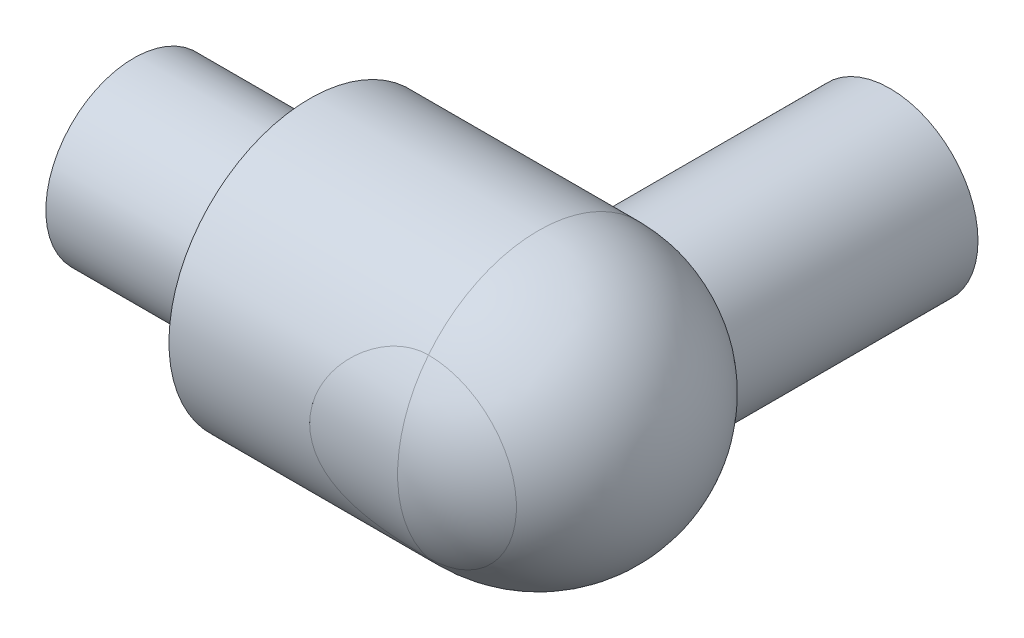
ISO-10303-21;
HEADER;
FILE_DESCRIPTION(('STEP AP214'),'2;1');
FILE_NAME('part.step','',(''),(''),'','','');
FILE_SCHEMA(('AUTOMOTIVE_DESIGN { 1 0 10303 214 1 1 1 1 }'));
ENDSEC;
DATA;
#1=APPLICATION_CONTEXT('core data for automotive mechanical design processes');
#2=APPLICATION_PROTOCOL_DEFINITION('international standard','automotive_design',2000,#1);
#3=PRODUCT_CONTEXT('',#1,'mechanical');
#4=PRODUCT('Part','Part','',(#3));
#5=PRODUCT_RELATED_PRODUCT_CATEGORY('part','',(#4));
#6=PRODUCT_DEFINITION_FORMATION('','',#4);
#7=PRODUCT_DEFINITION_CONTEXT('part definition',#1,'design');
#8=PRODUCT_DEFINITION('design','',#6,#7);
#9=PRODUCT_DEFINITION_SHAPE('','',#8);
#10=(LENGTH_UNIT() NAMED_UNIT(*) SI_UNIT(.MILLI.,.METRE.));
#11=(NAMED_UNIT(*) PLANE_ANGLE_UNIT() SI_UNIT($,.RADIAN.));
#12=(NAMED_UNIT(*) SI_UNIT($,.STERADIAN.) SOLID_ANGLE_UNIT());
#13=UNCERTAINTY_MEASURE_WITH_UNIT(LENGTH_MEASURE(1.E-05),#10,'distance_accuracy_value','');
#14=(GEOMETRIC_REPRESENTATION_CONTEXT(3) GLOBAL_UNCERTAINTY_ASSIGNED_CONTEXT((#13)) GLOBAL_UNIT_ASSIGNED_CONTEXT((#10,
#11,#12)) REPRESENTATION_CONTEXT('',''));
#15=CARTESIAN_POINT('',(0.,0.,0.));
#16=DIRECTION('',(0.,0.,1.));
#17=DIRECTION('',(1.,0.,0.));
#18=AXIS2_PLACEMENT_3D('',#15,#16,#17);
#19=CARTESIAN_POINT('',(23.,0.,8.001));
#20=DIRECTION('',(0.,0.,-1.));
#21=DIRECTION('',(-1.,0.,0.));
#22=AXIS2_PLACEMENT_3D('',#19,#20,#21);
#23=CYLINDRICAL_SURFACE('',#22,5.);
#24=CARTESIAN_POINT('',(23.,0.,-20.));
#25=DIRECTION('',(0.,0.,1.));
#26=DIRECTION('',(1.,0.,0.));
#27=AXIS2_PLACEMENT_3D('',#24,#25,#26);
#28=CIRCLE('',#27,5.);
#29=CARTESIAN_POINT('',(28.,0.,-20.));
#30=VERTEX_POINT('',#29);
#31=EDGE_CURVE('E12',#30,#30,#28,.T.);
#32=ORIENTED_EDGE('',*,*,#31,.T.);
#33=EDGE_LOOP('',(#32));
#34=FACE_BOUND('',#33,.T.);
#35=CARTESIAN_POINT('',(23.,0.,6.2449979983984));
#36=DIRECTION('',(0.,0.,-1.));
#37=DIRECTION('',(-1.,0.,0.));
#38=AXIS2_PLACEMENT_3D('',#35,#36,#37);
#39=CIRCLE('',#38,5.);
#40=CARTESIAN_POINT('',(23.,-5.,6.2449979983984));
#41=VERTEX_POINT('',#40);
#42=CARTESIAN_POINT('',(23.,5.,6.2449979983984));
#43=VERTEX_POINT('',#42);
#44=EDGE_CURVE('E52',#41,#43,#39,.F.);
#45=ORIENTED_EDGE('',*,*,#44,.F.);
#46=CARTESIAN_POINT('',(18.,0.,8.));
#47=CARTESIAN_POINT('',(18.000000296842,-0.127079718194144,7.99999969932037));
#48=CARTESIAN_POINT('',(18.0048512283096,-0.254165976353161,7.99696526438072));
#49=CARTESIAN_POINT('',(18.0241874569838,-0.507365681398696,7.98490163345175));
#50=CARTESIAN_POINT('',(18.0386769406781,-0.633478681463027,7.97586983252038));
#51=CARTESIAN_POINT('',(18.0771121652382,-0.883879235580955,7.95201844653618));
#52=CARTESIAN_POINT('',(18.101071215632,-1.00816396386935,7.93719071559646));
#53=CARTESIAN_POINT('',(18.1581302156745,-1.25388007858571,7.90210083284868));
#54=CARTESIAN_POINT('',(18.1912340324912,-1.3753102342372,7.88183638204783));
#55=CARTESIAN_POINT('',(18.2659676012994,-1.61383677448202,7.83646507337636));
#56=CARTESIAN_POINT('',(18.3075500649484,-1.73095311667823,7.81138511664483));
#57=CARTESIAN_POINT('',(18.3988984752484,-1.96091650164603,7.75685494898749));
#58=CARTESIAN_POINT('',(18.448667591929,-2.07376186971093,7.7274030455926));
#59=CARTESIAN_POINT('',(18.6094966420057,-2.40491190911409,7.63340708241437));
#60=CARTESIAN_POINT('',(18.7321634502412,-2.61609848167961,7.5631697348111));
#61=CARTESIAN_POINT('',(19.0155539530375,-3.03193014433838,7.40680295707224));
#62=CARTESIAN_POINT('',(19.178534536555,-3.23470598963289,7.31985233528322));
#63=CARTESIAN_POINT('',(19.5328993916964,-3.61195776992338,7.1412401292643));
#64=CARTESIAN_POINT('',(19.7243218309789,-3.78639500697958,7.04957232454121));
#65=CARTESIAN_POINT('',(20.0442857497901,-4.03551059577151,6.90836217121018));
#66=CARTESIAN_POINT('',(20.1642871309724,-4.12074022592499,6.85772204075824));
#67=CARTESIAN_POINT('',(20.4121510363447,-4.28074637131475,6.758996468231));
#68=CARTESIAN_POINT('',(20.5400150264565,-4.35552092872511,6.71091150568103));
#69=CARTESIAN_POINT('',(20.802884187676,-4.49385262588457,6.61907677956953));
#70=CARTESIAN_POINT('',(20.9378778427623,-4.55742717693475,6.57532033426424));
#71=CARTESIAN_POINT('',(21.2146224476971,-4.67278116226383,6.49385156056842));
#72=CARTESIAN_POINT('',(21.3563734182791,-4.72456056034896,6.45613925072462));
#73=CARTESIAN_POINT('',(21.6081335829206,-4.80367778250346,6.39737739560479));
#74=CARTESIAN_POINT('',(21.7168360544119,-4.83387146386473,6.37454329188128));
#75=CARTESIAN_POINT('',(21.9369191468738,-4.8869893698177,6.33391313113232));
#76=CARTESIAN_POINT('',(22.0482991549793,-4.90991524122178,6.31611593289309));
#77=CARTESIAN_POINT('',(22.2729763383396,-4.94817199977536,6.2861900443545));
#78=CARTESIAN_POINT('',(22.3862710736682,-4.96351189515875,6.27405463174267));
#79=CARTESIAN_POINT('',(22.6141412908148,-4.98640391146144,6.25587655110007));
#80=CARTESIAN_POINT('',(22.7287168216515,-4.99395573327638,6.249834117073));
#81=CARTESIAN_POINT('',(22.9585586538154,-5.00115324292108,6.24407626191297));
#82=CARTESIAN_POINT('',(23.0738259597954,-5.00077951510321,6.24437637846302));
#83=CARTESIAN_POINT('',(23.3039059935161,-4.99208386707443,6.2513301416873));
#84=CARTESIAN_POINT('',(23.4187185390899,-4.98375903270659,6.25798611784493));
#85=CARTESIAN_POINT('',(23.6470210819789,-4.95928874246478,6.27739584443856));
#86=CARTESIAN_POINT('',(23.7605106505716,-4.94314081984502,6.29015151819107));
#87=CARTESIAN_POINT('',(23.9853862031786,-4.90327193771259,6.32127805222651));
#88=CARTESIAN_POINT('',(24.0967712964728,-4.87954784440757,6.33965123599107));
#89=CARTESIAN_POINT('',(24.4216199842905,-4.79874186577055,6.40129934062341));
#90=CARTESIAN_POINT('',(24.6312924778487,-4.73140686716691,6.4516270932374));
#91=CARTESIAN_POINT('',(25.0366820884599,-4.57160139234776,6.565824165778));
#92=CARTESIAN_POINT('',(25.2323942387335,-4.47912202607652,6.62969827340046));
#93=CARTESIAN_POINT('',(25.6433146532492,-4.25180409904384,6.77818972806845));
#94=CARTESIAN_POINT('',(25.855335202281,-4.1122797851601,6.86445305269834));
#95=CARTESIAN_POINT('',(26.2553491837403,-3.80349790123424,7.04023909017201));
#96=CARTESIAN_POINT('',(26.443317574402,-3.63420977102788,7.12976507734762));
#97=CARTESIAN_POINT('',(26.7195685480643,-3.34462792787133,7.26825220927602));
#98=CARTESIAN_POINT('',(26.816742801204,-3.23332743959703,7.31856628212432));
#99=CARTESIAN_POINT('',(27.0013511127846,-3.00184758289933,7.4165140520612));
#100=CARTESIAN_POINT('',(27.0887887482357,-2.88167150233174,7.464148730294));
#101=CARTESIAN_POINT('',(27.2532332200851,-2.63291547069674,7.55548277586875));
#102=CARTESIAN_POINT('',(27.3302372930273,-2.50433330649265,7.59918109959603));
#103=CARTESIAN_POINT('',(27.4729252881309,-2.23953943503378,7.68138405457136));
#104=CARTESIAN_POINT('',(27.5386161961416,-2.1033325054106,7.71989188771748));
#105=CARTESIAN_POINT('',(27.6546688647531,-1.83158498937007,7.78870197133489));
#106=CARTESIAN_POINT('',(27.7056622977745,-1.69639792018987,7.81933279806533));
#107=CARTESIAN_POINT('',(27.796020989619,-1.42097512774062,7.87404113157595));
#108=CARTESIAN_POINT('',(27.8353928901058,-1.28074233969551,7.89812238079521));
#109=CARTESIAN_POINT('',(27.9018673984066,-0.996484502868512,7.9389934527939));
#110=CARTESIAN_POINT('',(27.9289810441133,-0.852462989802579,7.95578983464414));
#111=CARTESIAN_POINT('',(27.970490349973,-0.561915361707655,7.98157299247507));
#112=CARTESIAN_POINT('',(27.9848881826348,-0.415389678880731,7.99056110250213));
#113=CARTESIAN_POINT('',(27.999520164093,-0.143238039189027,7.99969867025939));
#114=CARTESIAN_POINT('',(28.001540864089,-0.017741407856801,8.00096292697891));
#115=CARTESIAN_POINT('',(27.9961427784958,0.232966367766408,7.99758945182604));
#116=CARTESIAN_POINT('',(27.9887246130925,0.358177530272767,7.9929521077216));
#117=CARTESIAN_POINT('',(27.9645562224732,0.60732783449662,7.97789005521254));
#118=CARTESIAN_POINT('',(27.9478068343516,0.731267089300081,7.96746586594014));
#119=CARTESIAN_POINT('',(27.9052093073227,0.97696969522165,7.9410830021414));
#120=CARTESIAN_POINT('',(27.87936100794,1.09873300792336,7.92512423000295));
#121=CARTESIAN_POINT('',(27.8200905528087,1.33450834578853,7.88877344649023));
#122=CARTESIAN_POINT('',(27.7870073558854,1.44863666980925,7.8685811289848));
#123=CARTESIAN_POINT('',(27.7131109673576,1.67350231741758,7.82384532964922));
#124=CARTESIAN_POINT('',(27.6722951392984,1.78423846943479,7.7993003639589));
#125=CARTESIAN_POINT('',(27.5388502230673,2.11043845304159,7.7198451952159));
#126=CARTESIAN_POINT('',(27.4351772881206,2.32007565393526,7.65908557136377));
#127=CARTESIAN_POINT('',(27.1899279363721,2.74037159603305,7.51959499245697));
#128=CARTESIAN_POINT('',(27.0455818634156,2.94899750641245,7.43966908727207));
#129=CARTESIAN_POINT('',(26.7288284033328,3.340560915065,7.27228030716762));
#130=CARTESIAN_POINT('',(26.5563898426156,3.52346945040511,7.18480911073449));
#131=CARTESIAN_POINT('',(26.1594550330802,3.88590040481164,6.99623419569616));
#132=CARTESIAN_POINT('',(25.9310356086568,4.06107692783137,6.89499476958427));
#133=CARTESIAN_POINT('',(25.4445124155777,4.37121122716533,6.70267107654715));
#134=CARTESIAN_POINT('',(25.186429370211,4.50619684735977,6.61157980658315));
#135=CARTESIAN_POINT('',(24.7011860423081,4.70739703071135,6.46933988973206));
#136=CARTESIAN_POINT('',(24.478884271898,4.78209607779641,6.41382106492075));
#137=CARTESIAN_POINT('',(24.1364345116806,4.87056932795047,6.34656596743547));
#138=CARTESIAN_POINT('',(24.0208098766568,4.89612834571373,6.32682054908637));
#139=CARTESIAN_POINT('',(23.787213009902,4.93906627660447,6.29335959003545));
#140=CARTESIAN_POINT('',(23.6692418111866,4.95644870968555,6.27964145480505));
#141=CARTESIAN_POINT('',(23.4310629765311,4.98283345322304,6.25872646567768));
#142=CARTESIAN_POINT('',(23.3108461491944,4.99178464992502,6.25156939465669));
#143=CARTESIAN_POINT('',(23.0698650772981,5.00096567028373,6.24422754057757));
#144=CARTESIAN_POINT('',(22.9491008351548,5.00119553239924,6.24404272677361));
#145=CARTESIAN_POINT('',(22.7080244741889,4.99292458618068,6.25065867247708));
#146=CARTESIAN_POINT('',(22.5877125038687,4.98442112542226,6.2574615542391));
#147=CARTESIAN_POINT('',(22.3486063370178,4.95884706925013,6.27774556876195));
#148=CARTESIAN_POINT('',(22.2298121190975,4.94177659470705,6.2912266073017));
#149=CARTESIAN_POINT('',(21.8960286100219,4.88153513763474,6.33822773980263));
#150=CARTESIAN_POINT('',(21.6837622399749,4.82847742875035,6.37907576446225));
#151=CARTESIAN_POINT('',(21.271420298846,4.69670428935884,6.47669777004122));
#152=CARTESIAN_POINT('',(21.0713498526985,4.61797815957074,6.53347839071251));
#153=CARTESIAN_POINT('',(20.657624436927,4.42410573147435,6.66655793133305));
#154=CARTESIAN_POINT('',(20.4461960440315,4.30533683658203,6.74449249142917));
#155=CARTESIAN_POINT('',(20.0442492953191,4.04000963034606,6.90670498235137));
#156=CARTESIAN_POINT('',(19.8537480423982,3.89342885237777,6.99098800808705));
#157=CARTESIAN_POINT('',(19.4599160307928,3.54264024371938,7.17608994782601));
#158=CARTESIAN_POINT('',(19.2615221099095,3.33276887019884,7.27687640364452));
#159=CARTESIAN_POINT('',(18.9918997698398,2.99268031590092,7.42018359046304));
#160=CARTESIAN_POINT('',(18.9066216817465,2.87498419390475,7.46667962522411));
#161=CARTESIAN_POINT('',(18.7460851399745,2.63162062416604,7.55588019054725));
#162=CARTESIAN_POINT('',(18.6708214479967,2.50595739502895,7.59858669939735));
#163=CARTESIAN_POINT('',(18.5308937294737,2.24695585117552,7.67916888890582));
#164=CARTESIAN_POINT('',(18.4662558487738,2.11359966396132,7.71703260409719));
#165=CARTESIAN_POINT('',(18.3486499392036,1.84039127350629,7.78670745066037));
#166=CARTESIAN_POINT('',(18.2956751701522,1.70054287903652,7.81852207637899));
#167=CARTESIAN_POINT('',(18.2022871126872,1.41574969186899,7.87506644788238));
#168=CARTESIAN_POINT('',(18.1618400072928,1.2708198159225,7.89981525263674));
#169=CARTESIAN_POINT('',(18.0940489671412,0.976912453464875,7.94151359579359));
#170=CARTESIAN_POINT('',(18.0666953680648,0.827938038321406,7.95846888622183));
#171=CARTESIAN_POINT('',(18.0308184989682,0.565708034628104,7.98076605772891));
#172=CARTESIAN_POINT('',(18.0192744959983,0.453012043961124,7.98796542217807));
#173=CARTESIAN_POINT('',(18.0038648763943,0.22687913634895,7.99758267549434));
#174=CARTESIAN_POINT('',(17.9999997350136,0.113442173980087,8.00000026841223));
#175=CARTESIAN_POINT('',(18.,0.,8.));
#176=B_SPLINE_CURVE_WITH_KNOTS('',3,(#46,#47,#48,#49,#50,#51,#52,#53,#54,#55,#56,#57,#58,#59,
#60,#61,#62,#63,#64,#65,#66,#67,#68,#69,#70,#71,#72,#73,#74,#75,#76,#77,#78,#79,#80,#81,#82,#83,
#84,#85,#86,#87,#88,#89,#90,#91,#92,#93,#94,#95,#96,#97,#98,#99,#100,#101,#102,#103,#104,#105,
#106,#107,#108,#109,#110,#111,#112,#113,#114,#115,#116,#117,#118,#119,#120,#121,#122,#123,#124,
#125,#126,#127,#128,#129,#130,#131,#132,#133,#134,#135,#136,#137,#138,#139,#140,#141,#142,#143,
#144,#145,#146,#147,#148,#149,#150,#151,#152,#153,#154,#155,#156,#157,#158,#159,#160,#161,#162,
#163,#164,#165,#166,#167,#168,#169,#170,#171,#172,#173,#174,#175),.UNSPECIFIED.,.T.,.F.,(4,2,2,
2,2,2,2,2,2,2,2,2,2,2,2,2,2,2,2,2,2,2,2,2,2,2,2,2,2,2,2,2,2,2,2,2,2,2,2,2,2,2,2,2,2,2,2,2,2,2,2,
2,2,2,2,2,2,2,2,2,2,2,2,2,4),(0.,0.381122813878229,0.762411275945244,1.14423755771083,
1.52622555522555,1.90613865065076,2.2861992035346,3.04547146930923,3.86537873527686,
4.68639638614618,5.15288943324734,5.61946971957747,6.08531814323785,6.55116799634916,
6.89615022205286,7.24105422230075,7.58554766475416,7.93005433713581,8.27540506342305,
8.62088241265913,8.96646876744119,9.31219825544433,9.98712845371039,10.6622975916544,
11.463592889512,12.2657157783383,12.7334704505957,13.2010527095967,13.6687585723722,
14.1361745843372,14.5786070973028,15.0207862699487,15.4625664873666,15.9042712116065,
16.280349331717,16.6564027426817,17.0324224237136,17.4084487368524,17.7696430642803,
18.1309607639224,18.8530325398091,19.6479898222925,20.4438353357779,21.355208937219,
22.2659496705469,22.9857781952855,23.3455439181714,23.705154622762,24.0669316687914,
24.4287071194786,24.7905924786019,25.1524727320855,25.8172983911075,26.482401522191,
27.2437925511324,28.0058012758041,28.9187931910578,29.3761295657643,29.8332257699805,
30.2914303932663,30.7493695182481,31.2060614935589,31.6624158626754,32.0026174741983,
32.3428401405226),.UNSPECIFIED.);
#177=EDGE_CURVE('E61',#43,#41,#176,.T.);
#178=ORIENTED_EDGE('',*,*,#177,.F.);
#179=EDGE_LOOP('',(#45,#178));
#180=FACE_BOUND('',#179,.T.);
#181=ADVANCED_FACE('F45',(#34,#180),#23,.T.);
#182=CARTESIAN_POINT('',(23.,0.,-20.));
#183=DIRECTION('',(0.,0.,1.));
#184=DIRECTION('',(1.,0.,0.));
#185=AXIS2_PLACEMENT_3D('',#182,#183,#184);
#186=PLANE('',#185);
#187=ORIENTED_EDGE('',*,*,#31,.F.);
#188=EDGE_LOOP('',(#187));
#189=FACE_BOUND('',#188,.T.);
#190=ADVANCED_FACE('F78',(#189),#186,.F.);
#191=CARTESIAN_POINT('',(23.,0.,0.));
#192=DIRECTION('',(-1.,0.,0.));
#193=DIRECTION('',(0.,1.,0.));
#194=AXIS2_PLACEMENT_3D('',#191,#192,#193);
#195=SPHERICAL_SURFACE('',#194,8.);
#196=ORIENTED_EDGE('',*,*,#44,.T.);
#197=CARTESIAN_POINT('',(23.,0.,0.));
#198=DIRECTION('',(-1.,0.,0.));
#199=DIRECTION('',(0.,0.,1.));
#200=AXIS2_PLACEMENT_3D('',#197,#198,#199);
#201=CIRCLE('',#200,8.);
#202=EDGE_CURVE('E58',#41,#43,#201,.T.);
#203=ORIENTED_EDGE('',*,*,#202,.F.);
#204=EDGE_LOOP('',(#196,#203));
#205=FACE_BOUND('',#204,.T.);
#206=ADVANCED_FACE('F67',(#205),#195,.T.);
#207=CARTESIAN_POINT('',(0.,0.,0.));
#208=DIRECTION('',(-1.,0.,0.));
#209=DIRECTION('',(0.,0.,1.));
#210=AXIS2_PLACEMENT_3D('',#207,#208,#209);
#211=CYLINDRICAL_SURFACE('',#210,8.);
#212=ORIENTED_EDGE('',*,*,#177,.T.);
#213=ORIENTED_EDGE('',*,*,#202,.T.);
#214=EDGE_LOOP('',(#212,#213));
#215=FACE_BOUND('',#214,.T.);
#216=ADVANCED_FACE('F62',(#215),#211,.T.);
#217=CLOSED_SHELL('',(#181,#190,#206,#216));
#218=MANIFOLD_SOLID_BREP('B2',#217);
#219=CARTESIAN_POINT('',(31.,0.,0.));
#220=DIRECTION('',(-1.,0.,0.));
#221=DIRECTION('',(0.,0.,1.));
#222=AXIS2_PLACEMENT_3D('',#219,#220,#221);
#223=CYLINDRICAL_SURFACE('',#222,8.);
#224=CARTESIAN_POINT('',(10.,0.,0.));
#225=DIRECTION('',(1.,0.,0.));
#226=DIRECTION('',(0.,0.,-1.));
#227=AXIS2_PLACEMENT_3D('',#224,#225,#226);
#228=CIRCLE('',#227,8.);
#229=CARTESIAN_POINT('',(10.,0.,-8.));
#230=VERTEX_POINT('',#229);
#231=EDGE_CURVE('E156',#230,#230,#228,.T.);
#232=ORIENTED_EDGE('',*,*,#231,.T.);
#233=EDGE_LOOP('',(#232));
#234=FACE_BOUND('',#233,.T.);
#235=CARTESIAN_POINT('',(23.,0.,0.));
#236=DIRECTION('',(-1.,0.,0.));
#237=DIRECTION('',(0.,0.,1.));
#238=AXIS2_PLACEMENT_3D('',#235,#236,#237);
#239=CIRCLE('',#238,8.);
#240=CARTESIAN_POINT('',(23.,-5.,-6.2449979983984));
#241=VERTEX_POINT('',#240);
#242=CARTESIAN_POINT('',(23.,-5.,6.2449979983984));
#243=VERTEX_POINT('',#242);
#244=EDGE_CURVE('E131',#241,#243,#239,.T.);
#245=ORIENTED_EDGE('',*,*,#244,.T.);
#246=CARTESIAN_POINT('',(28.,0.,8.));
#247=CARTESIAN_POINT('',(27.999999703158,-0.127079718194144,7.99999969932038));
#248=CARTESIAN_POINT('',(27.9951487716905,-0.254165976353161,7.99696526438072));
#249=CARTESIAN_POINT('',(27.9758125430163,-0.507365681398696,7.98490163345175));
#250=CARTESIAN_POINT('',(27.9613230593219,-0.633478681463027,7.97586983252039));
#251=CARTESIAN_POINT('',(27.9228878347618,-0.883879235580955,7.95201844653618));
#252=CARTESIAN_POINT('',(27.898928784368,-1.00816396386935,7.93719071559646));
#253=CARTESIAN_POINT('',(27.8418697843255,-1.25388007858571,7.90210083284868));
#254=CARTESIAN_POINT('',(27.8087659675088,-1.3753102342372,7.88183638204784));
#255=CARTESIAN_POINT('',(27.7340323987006,-1.61383677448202,7.83646507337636));
#256=CARTESIAN_POINT('',(27.6924499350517,-1.73095311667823,7.81138511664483));
#257=CARTESIAN_POINT('',(27.6011015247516,-1.96091650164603,7.75685494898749));
#258=CARTESIAN_POINT('',(27.551332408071,-2.07376186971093,7.7274030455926));
#259=CARTESIAN_POINT('',(27.3905033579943,-2.40491190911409,7.63340708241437));
#260=CARTESIAN_POINT('',(27.2678365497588,-2.61609848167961,7.5631697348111));
#261=CARTESIAN_POINT('',(26.9844460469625,-3.03193014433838,7.40680295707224));
#262=CARTESIAN_POINT('',(26.821465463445,-3.23470598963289,7.31985233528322));
#263=CARTESIAN_POINT('',(26.4671006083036,-3.61195776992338,7.1412401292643));
#264=CARTESIAN_POINT('',(26.2756781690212,-3.78639500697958,7.04957232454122));
#265=CARTESIAN_POINT('',(25.9557142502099,-4.03551059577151,6.90836217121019));
#266=CARTESIAN_POINT('',(25.8357128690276,-4.12074022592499,6.85772204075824));
#267=CARTESIAN_POINT('',(25.5878489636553,-4.28074637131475,6.75899646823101));
#268=CARTESIAN_POINT('',(25.4599849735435,-4.35552092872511,6.71091150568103));
#269=CARTESIAN_POINT('',(25.197115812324,-4.49385262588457,6.61907677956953));
#270=CARTESIAN_POINT('',(25.0621221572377,-4.55742717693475,6.57532033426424));
#271=CARTESIAN_POINT('',(24.7853775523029,-4.67278116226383,6.49385156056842));
#272=CARTESIAN_POINT('',(24.6436265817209,-4.72456056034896,6.45613925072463));
#273=CARTESIAN_POINT('',(24.3918664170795,-4.80367778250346,6.39737739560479));
#274=CARTESIAN_POINT('',(24.2831639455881,-4.83387146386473,6.37454329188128));
#275=CARTESIAN_POINT('',(24.0630808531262,-4.8869893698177,6.33391313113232));
#276=CARTESIAN_POINT('',(23.9517008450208,-4.90991524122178,6.31611593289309));
#277=CARTESIAN_POINT('',(23.7270236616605,-4.94817199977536,6.28619004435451));
#278=CARTESIAN_POINT('',(23.6137289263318,-4.96351189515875,6.27405463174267));
#279=CARTESIAN_POINT('',(23.3858587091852,-4.98640391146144,6.25587655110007));
#280=CARTESIAN_POINT('',(23.2712831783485,-4.99395573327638,6.24983411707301));
#281=CARTESIAN_POINT('',(23.0414413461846,-5.00115324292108,6.24407626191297));
#282=CARTESIAN_POINT('',(22.9261740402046,-5.00077951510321,6.24437637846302));
#283=CARTESIAN_POINT('',(22.6960940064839,-4.99208386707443,6.2513301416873));
#284=CARTESIAN_POINT('',(22.5812814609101,-4.98375903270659,6.25798611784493));
#285=CARTESIAN_POINT('',(22.3529789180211,-4.95928874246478,6.27739584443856));
#286=CARTESIAN_POINT('',(22.2394893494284,-4.94314081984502,6.29015151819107));
#287=CARTESIAN_POINT('',(22.0146137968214,-4.90327193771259,6.32127805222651));
#288=CARTESIAN_POINT('',(21.9032287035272,-4.87954784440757,6.33965123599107));
#289=CARTESIAN_POINT('',(21.5783800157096,-4.79874186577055,6.40129934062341));
#290=CARTESIAN_POINT('',(21.3687075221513,-4.73140686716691,6.45162709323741));
#291=CARTESIAN_POINT('',(20.9633179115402,-4.57160139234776,6.565824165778));
#292=CARTESIAN_POINT('',(20.7676057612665,-4.47912202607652,6.62969827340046));
#293=CARTESIAN_POINT('',(20.3566853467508,-4.25180409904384,6.77818972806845));
#294=CARTESIAN_POINT('',(20.1446647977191,-4.11227978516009,6.86445305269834));
#295=CARTESIAN_POINT('',(19.7446508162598,-3.80349790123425,7.04023909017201));
#296=CARTESIAN_POINT('',(19.556682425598,-3.63420977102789,7.12976507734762));
#297=CARTESIAN_POINT('',(19.2804314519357,-3.34462792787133,7.26825220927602));
#298=CARTESIAN_POINT('',(19.1832571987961,-3.23332743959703,7.31856628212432));
#299=CARTESIAN_POINT('',(18.9986488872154,-3.00184758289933,7.4165140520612));
#300=CARTESIAN_POINT('',(18.9112112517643,-2.88167150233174,7.46414873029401));
#301=CARTESIAN_POINT('',(18.7467667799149,-2.63291547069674,7.55548277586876));
#302=CARTESIAN_POINT('',(18.6697627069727,-2.50433330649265,7.59918109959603));
#303=CARTESIAN_POINT('',(18.5270747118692,-2.23953943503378,7.68138405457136));
#304=CARTESIAN_POINT('',(18.4613838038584,-2.1033325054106,7.71989188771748));
#305=CARTESIAN_POINT('',(18.3453311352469,-1.83158498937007,7.78870197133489));
#306=CARTESIAN_POINT('',(18.2943377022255,-1.69639792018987,7.81933279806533));
#307=CARTESIAN_POINT('',(18.203979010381,-1.42097512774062,7.87404113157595));
#308=CARTESIAN_POINT('',(18.1646071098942,-1.28074233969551,7.89812238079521));
#309=CARTESIAN_POINT('',(18.0981326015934,-0.996484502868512,7.93899345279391));
#310=CARTESIAN_POINT('',(18.0710189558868,-0.852462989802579,7.95578983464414));
#311=CARTESIAN_POINT('',(18.029509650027,-0.561915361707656,7.98157299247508));
#312=CARTESIAN_POINT('',(18.0151118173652,-0.415389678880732,7.99056110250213));
#313=CARTESIAN_POINT('',(18.000479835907,-0.143238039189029,7.99969867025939));
#314=CARTESIAN_POINT('',(17.998459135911,-0.0177414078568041,8.00096292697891));
#315=CARTESIAN_POINT('',(18.0038572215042,0.232966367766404,7.99758945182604));
#316=CARTESIAN_POINT('',(18.0112753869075,0.358177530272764,7.9929521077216));
#317=CARTESIAN_POINT('',(18.0354437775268,0.607327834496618,7.97789005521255));
#318=CARTESIAN_POINT('',(18.0521931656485,0.73126708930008,7.96746586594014));
#319=CARTESIAN_POINT('',(18.0947906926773,0.97696969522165,7.94108300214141));
#320=CARTESIAN_POINT('',(18.12063899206,1.09873300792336,7.92512423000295));
#321=CARTESIAN_POINT('',(18.1799094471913,1.33450834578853,7.88877344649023));
#322=CARTESIAN_POINT('',(18.2129926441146,1.44863666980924,7.86858112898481));
#323=CARTESIAN_POINT('',(18.2868890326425,1.67350231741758,7.82384532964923));
#324=CARTESIAN_POINT('',(18.3277048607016,1.78423846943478,7.7993003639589));
#325=CARTESIAN_POINT('',(18.4611497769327,2.11043845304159,7.7198451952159));
#326=CARTESIAN_POINT('',(18.5648227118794,2.32007565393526,7.65908557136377));
#327=CARTESIAN_POINT('',(18.8100720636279,2.74037159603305,7.51959499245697));
#328=CARTESIAN_POINT('',(18.9544181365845,2.94899750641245,7.43966908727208));
#329=CARTESIAN_POINT('',(19.2711715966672,3.340560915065,7.27228030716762));
#330=CARTESIAN_POINT('',(19.4436101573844,3.52346945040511,7.18480911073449));
#331=CARTESIAN_POINT('',(19.8405449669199,3.88590040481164,6.99623419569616));
#332=CARTESIAN_POINT('',(20.0689643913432,4.06107692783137,6.89499476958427));
#333=CARTESIAN_POINT('',(20.5554875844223,4.37121122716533,6.70267107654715));
#334=CARTESIAN_POINT('',(20.813570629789,4.50619684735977,6.61157980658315));
#335=CARTESIAN_POINT('',(21.2988139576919,4.70739703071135,6.46933988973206));
#336=CARTESIAN_POINT('',(21.5211157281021,4.78209607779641,6.41382106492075));
#337=CARTESIAN_POINT('',(21.8635654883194,4.87056932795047,6.34656596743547));
#338=CARTESIAN_POINT('',(21.9791901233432,4.89612834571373,6.32682054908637));
#339=CARTESIAN_POINT('',(22.212786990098,4.93906627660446,6.29335959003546));
#340=CARTESIAN_POINT('',(22.3307581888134,4.95644870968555,6.27964145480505));
#341=CARTESIAN_POINT('',(22.568937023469,4.98283345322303,6.25872646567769));
#342=CARTESIAN_POINT('',(22.6891538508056,4.99178464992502,6.25156939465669));
#343=CARTESIAN_POINT('',(22.9301349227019,5.00096567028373,6.24422754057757));
#344=CARTESIAN_POINT('',(23.0508991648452,5.00119553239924,6.24404272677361));
#345=CARTESIAN_POINT('',(23.2919755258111,4.99292458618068,6.25065867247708));
#346=CARTESIAN_POINT('',(23.4122874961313,4.98442112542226,6.2574615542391));
#347=CARTESIAN_POINT('',(23.6513936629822,4.95884706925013,6.27774556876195));
#348=CARTESIAN_POINT('',(23.7701878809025,4.94177659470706,6.2912266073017));
#349=CARTESIAN_POINT('',(24.1039713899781,4.88153513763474,6.33822773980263));
#350=CARTESIAN_POINT('',(24.3162377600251,4.82847742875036,6.37907576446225));
#351=CARTESIAN_POINT('',(24.728579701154,4.69670428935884,6.47669777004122));
#352=CARTESIAN_POINT('',(24.9286501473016,4.61797815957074,6.53347839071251));
#353=CARTESIAN_POINT('',(25.342375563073,4.42410573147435,6.66655793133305));
#354=CARTESIAN_POINT('',(25.5538039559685,4.30533683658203,6.74449249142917));
#355=CARTESIAN_POINT('',(25.9557507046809,4.04000963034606,6.90670498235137));
#356=CARTESIAN_POINT('',(26.1462519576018,3.89342885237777,6.99098800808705));
#357=CARTESIAN_POINT('',(26.5400839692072,3.54264024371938,7.17608994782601));
#358=CARTESIAN_POINT('',(26.7384778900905,3.33276887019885,7.27687640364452));
#359=CARTESIAN_POINT('',(27.0081002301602,2.99268031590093,7.42018359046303));
#360=CARTESIAN_POINT('',(27.0933783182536,2.87498419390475,7.4666796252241));
#361=CARTESIAN_POINT('',(27.2539148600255,2.63162062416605,7.55588019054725));
#362=CARTESIAN_POINT('',(27.3291785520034,2.50595739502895,7.59858669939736));
#363=CARTESIAN_POINT('',(27.4691062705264,2.24695585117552,7.67916888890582));
#364=CARTESIAN_POINT('',(27.5337441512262,2.11359966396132,7.71703260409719));
#365=CARTESIAN_POINT('',(27.6513500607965,1.84039127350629,7.78670745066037));
#366=CARTESIAN_POINT('',(27.7043248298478,1.70054287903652,7.81852207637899));
#367=CARTESIAN_POINT('',(27.7977128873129,1.41574969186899,7.87506644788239));
#368=CARTESIAN_POINT('',(27.8381599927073,1.2708198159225,7.89981525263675));
#369=CARTESIAN_POINT('',(27.9059510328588,0.976912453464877,7.9415135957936));
#370=CARTESIAN_POINT('',(27.9333046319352,0.827938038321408,7.95846888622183));
#371=CARTESIAN_POINT('',(27.9691815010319,0.565708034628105,7.98076605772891));
#372=CARTESIAN_POINT('',(27.9807255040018,0.453012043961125,7.98796542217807));
#373=CARTESIAN_POINT('',(27.9961351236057,0.22687913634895,7.99758267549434));
#374=CARTESIAN_POINT('',(28.0000002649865,0.113442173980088,8.00000026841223));
#375=CARTESIAN_POINT('',(28.,0.,8.));
#376=B_SPLINE_CURVE_WITH_KNOTS('',3,(#246,#247,#248,#249,#250,#251,#252,#253,#254,#255,#256,
#257,#258,#259,#260,#261,#262,#263,#264,#265,#266,#267,#268,#269,#270,#271,#272,#273,#274,#275,
#276,#277,#278,#279,#280,#281,#282,#283,#284,#285,#286,#287,#288,#289,#290,#291,#292,#293,#294,
#295,#296,#297,#298,#299,#300,#301,#302,#303,#304,#305,#306,#307,#308,#309,#310,#311,#312,#313,
#314,#315,#316,#317,#318,#319,#320,#321,#322,#323,#324,#325,#326,#327,#328,#329,#330,#331,#332,
#333,#334,#335,#336,#337,#338,#339,#340,#341,#342,#343,#344,#345,#346,#347,#348,#349,#350,#351,
#352,#353,#354,#355,#356,#357,#358,#359,#360,#361,#362,#363,#364,#365,#366,#367,#368,#369,#370,
#371,#372,#373,#374,#375),.UNSPECIFIED.,.T.,.F.,(4,2,2,2,2,2,2,2,2,2,2,2,2,2,2,2,2,2,2,2,2,2,2,
2,2,2,2,2,2,2,2,2,2,2,2,2,2,2,2,2,2,2,2,2,2,2,2,2,2,2,2,2,2,2,2,2,2,2,2,2,2,2,2,2,4),(0.,
0.381122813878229,0.762411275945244,1.14423755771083,1.52622555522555,1.90613865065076,
2.2861992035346,3.04547146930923,3.86537873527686,4.68639638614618,5.15288943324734,
5.61946971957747,6.08531814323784,6.55116799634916,6.89615022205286,7.24105422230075,
7.58554766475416,7.93005433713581,8.27540506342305,8.62088241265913,8.96646876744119,
9.31219825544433,9.98712845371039,10.6622975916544,11.463592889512,12.2657157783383,
12.7334704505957,13.2010527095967,13.6687585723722,14.1361745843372,14.5786070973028,
15.0207862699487,15.4625664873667,15.9042712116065,16.280349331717,16.6564027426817,
17.0324224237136,17.4084487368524,17.7696430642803,18.1309607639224,18.8530325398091,
19.6479898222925,20.4438353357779,21.355208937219,22.2659496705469,22.9857781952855,
23.3455439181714,23.705154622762,24.0669316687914,24.4287071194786,24.7905924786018,
25.1524727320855,25.8172983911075,26.482401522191,27.2437925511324,28.0058012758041,
28.9187931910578,29.3761295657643,29.8332257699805,30.2914303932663,30.7493695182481,
31.2060614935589,31.6624158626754,32.0026174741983,32.3428401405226),.UNSPECIFIED.);
#377=CARTESIAN_POINT('',(23.,5.,6.2449979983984));
#378=VERTEX_POINT('',#377);
#379=EDGE_CURVE('E155',#243,#378,#376,.T.);
#380=ORIENTED_EDGE('',*,*,#379,.T.);
#381=CARTESIAN_POINT('',(23.,5.,-6.2449979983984));
#382=VERTEX_POINT('',#381);
#383=EDGE_CURVE('E143',#378,#382,#239,.T.);
#384=ORIENTED_EDGE('',*,*,#383,.T.);
#385=CARTESIAN_POINT('',(28.,0.,-8.));
#386=CARTESIAN_POINT('',(27.999999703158,0.127079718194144,-7.99999969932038));
#387=CARTESIAN_POINT('',(27.9951487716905,0.254165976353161,-7.99696526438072));
#388=CARTESIAN_POINT('',(27.9758125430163,0.507365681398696,-7.98490163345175));
#389=CARTESIAN_POINT('',(27.9613230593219,0.633478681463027,-7.97586983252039));
#390=CARTESIAN_POINT('',(27.9228878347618,0.883879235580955,-7.95201844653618));
#391=CARTESIAN_POINT('',(27.898928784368,1.00816396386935,-7.93719071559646));
#392=CARTESIAN_POINT('',(27.8418697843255,1.25388007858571,-7.90210083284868));
#393=CARTESIAN_POINT('',(27.8087659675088,1.3753102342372,-7.88183638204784));
#394=CARTESIAN_POINT('',(27.7340323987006,1.61383677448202,-7.83646507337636));
#395=CARTESIAN_POINT('',(27.6924499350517,1.73095311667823,-7.81138511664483));
#396=CARTESIAN_POINT('',(27.6011015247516,1.96091650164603,-7.75685494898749));
#397=CARTESIAN_POINT('',(27.551332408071,2.07376186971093,-7.7274030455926));
#398=CARTESIAN_POINT('',(27.3905033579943,2.40491190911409,-7.63340708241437));
#399=CARTESIAN_POINT('',(27.2678365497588,2.61609848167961,-7.5631697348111));
#400=CARTESIAN_POINT('',(26.9844460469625,3.03193014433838,-7.40680295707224));
#401=CARTESIAN_POINT('',(26.821465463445,3.23470598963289,-7.31985233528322));
#402=CARTESIAN_POINT('',(26.4671006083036,3.61195776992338,-7.1412401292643));
#403=CARTESIAN_POINT('',(26.2756781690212,3.78639500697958,-7.04957232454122));
#404=CARTESIAN_POINT('',(25.9557142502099,4.03551059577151,-6.90836217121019));
#405=CARTESIAN_POINT('',(25.8357128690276,4.12074022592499,-6.85772204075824));
#406=CARTESIAN_POINT('',(25.5878489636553,4.28074637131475,-6.75899646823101));
#407=CARTESIAN_POINT('',(25.4599849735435,4.35552092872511,-6.71091150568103));
#408=CARTESIAN_POINT('',(25.197115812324,4.49385262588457,-6.61907677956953));
#409=CARTESIAN_POINT('',(25.0621221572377,4.55742717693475,-6.57532033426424));
#410=CARTESIAN_POINT('',(24.7853775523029,4.67278116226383,-6.49385156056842));
#411=CARTESIAN_POINT('',(24.6436265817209,4.72456056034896,-6.45613925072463));
#412=CARTESIAN_POINT('',(24.3918664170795,4.80367778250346,-6.39737739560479));
#413=CARTESIAN_POINT('',(24.2831639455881,4.83387146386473,-6.37454329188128));
#414=CARTESIAN_POINT('',(24.0630808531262,4.8869893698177,-6.33391313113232));
#415=CARTESIAN_POINT('',(23.9517008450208,4.90991524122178,-6.31611593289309));
#416=CARTESIAN_POINT('',(23.7270236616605,4.94817199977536,-6.28619004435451));
#417=CARTESIAN_POINT('',(23.6137289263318,4.96351189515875,-6.27405463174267));
#418=CARTESIAN_POINT('',(23.3858587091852,4.98640391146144,-6.25587655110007));
#419=CARTESIAN_POINT('',(23.2712831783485,4.99395573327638,-6.24983411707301));
#420=CARTESIAN_POINT('',(23.0414413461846,5.00115324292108,-6.24407626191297));
#421=CARTESIAN_POINT('',(22.9261740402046,5.00077951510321,-6.24437637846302));
#422=CARTESIAN_POINT('',(22.6960940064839,4.99208386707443,-6.2513301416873));
#423=CARTESIAN_POINT('',(22.5812814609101,4.98375903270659,-6.25798611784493));
#424=CARTESIAN_POINT('',(22.3529789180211,4.95928874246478,-6.27739584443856));
#425=CARTESIAN_POINT('',(22.2394893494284,4.94314081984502,-6.29015151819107));
#426=CARTESIAN_POINT('',(22.0146137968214,4.90327193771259,-6.32127805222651));
#427=CARTESIAN_POINT('',(21.9032287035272,4.87954784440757,-6.33965123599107));
#428=CARTESIAN_POINT('',(21.5783800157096,4.79874186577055,-6.40129934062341));
#429=CARTESIAN_POINT('',(21.3687075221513,4.73140686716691,-6.45162709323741));
#430=CARTESIAN_POINT('',(20.9633179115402,4.57160139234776,-6.565824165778));
#431=CARTESIAN_POINT('',(20.7676057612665,4.47912202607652,-6.62969827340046));
#432=CARTESIAN_POINT('',(20.3566853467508,4.25180409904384,-6.77818972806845));
#433=CARTESIAN_POINT('',(20.1446647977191,4.11227978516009,-6.86445305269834));
#434=CARTESIAN_POINT('',(19.7446508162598,3.80349790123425,-7.04023909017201));
#435=CARTESIAN_POINT('',(19.556682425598,3.63420977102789,-7.12976507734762));
#436=CARTESIAN_POINT('',(19.2804314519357,3.34462792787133,-7.26825220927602));
#437=CARTESIAN_POINT('',(19.1832571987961,3.23332743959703,-7.31856628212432));
#438=CARTESIAN_POINT('',(18.9986488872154,3.00184758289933,-7.4165140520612));
#439=CARTESIAN_POINT('',(18.9112112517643,2.88167150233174,-7.46414873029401));
#440=CARTESIAN_POINT('',(18.7467667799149,2.63291547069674,-7.55548277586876));
#441=CARTESIAN_POINT('',(18.6697627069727,2.50433330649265,-7.59918109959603));
#442=CARTESIAN_POINT('',(18.5270747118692,2.23953943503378,-7.68138405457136));
#443=CARTESIAN_POINT('',(18.4613838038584,2.1033325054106,-7.71989188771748));
#444=CARTESIAN_POINT('',(18.3453311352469,1.83158498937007,-7.78870197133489));
#445=CARTESIAN_POINT('',(18.2943377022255,1.69639792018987,-7.81933279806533));
#446=CARTESIAN_POINT('',(18.203979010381,1.42097512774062,-7.87404113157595));
#447=CARTESIAN_POINT('',(18.1646071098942,1.28074233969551,-7.89812238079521));
#448=CARTESIAN_POINT('',(18.0981326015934,0.996484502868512,-7.93899345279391));
#449=CARTESIAN_POINT('',(18.0710189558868,0.852462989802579,-7.95578983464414));
#450=CARTESIAN_POINT('',(18.029509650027,0.561915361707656,-7.98157299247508));
#451=CARTESIAN_POINT('',(18.0151118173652,0.415389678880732,-7.99056110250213));
#452=CARTESIAN_POINT('',(18.000479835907,0.143238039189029,-7.99969867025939));
#453=CARTESIAN_POINT('',(17.998459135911,0.0177414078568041,-8.00096292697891));
#454=CARTESIAN_POINT('',(18.0038572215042,-0.232966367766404,-7.99758945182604));
#455=CARTESIAN_POINT('',(18.0112753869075,-0.358177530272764,-7.9929521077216));
#456=CARTESIAN_POINT('',(18.0354437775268,-0.607327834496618,-7.97789005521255));
#457=CARTESIAN_POINT('',(18.0521931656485,-0.73126708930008,-7.96746586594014));
#458=CARTESIAN_POINT('',(18.0947906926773,-0.97696969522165,-7.94108300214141));
#459=CARTESIAN_POINT('',(18.12063899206,-1.09873300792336,-7.92512423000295));
#460=CARTESIAN_POINT('',(18.1799094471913,-1.33450834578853,-7.88877344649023));
#461=CARTESIAN_POINT('',(18.2129926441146,-1.44863666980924,-7.86858112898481));
#462=CARTESIAN_POINT('',(18.2868890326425,-1.67350231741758,-7.82384532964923));
#463=CARTESIAN_POINT('',(18.3277048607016,-1.78423846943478,-7.7993003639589));
#464=CARTESIAN_POINT('',(18.4611497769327,-2.11043845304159,-7.7198451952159));
#465=CARTESIAN_POINT('',(18.5648227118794,-2.32007565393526,-7.65908557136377));
#466=CARTESIAN_POINT('',(18.8100720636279,-2.74037159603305,-7.51959499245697));
#467=CARTESIAN_POINT('',(18.9544181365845,-2.94899750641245,-7.43966908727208));
#468=CARTESIAN_POINT('',(19.2711715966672,-3.340560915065,-7.27228030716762));
#469=CARTESIAN_POINT('',(19.4436101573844,-3.52346945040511,-7.18480911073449));
#470=CARTESIAN_POINT('',(19.8405449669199,-3.88590040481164,-6.99623419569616));
#471=CARTESIAN_POINT('',(20.0689643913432,-4.06107692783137,-6.89499476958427));
#472=CARTESIAN_POINT('',(20.5554875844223,-4.37121122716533,-6.70267107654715));
#473=CARTESIAN_POINT('',(20.813570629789,-4.50619684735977,-6.61157980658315));
#474=CARTESIAN_POINT('',(21.2988139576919,-4.70739703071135,-6.46933988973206));
#475=CARTESIAN_POINT('',(21.5211157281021,-4.78209607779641,-6.41382106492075));
#476=CARTESIAN_POINT('',(21.8635654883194,-4.87056932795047,-6.34656596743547));
#477=CARTESIAN_POINT('',(21.9791901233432,-4.89612834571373,-6.32682054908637));
#478=CARTESIAN_POINT('',(22.212786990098,-4.93906627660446,-6.29335959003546));
#479=CARTESIAN_POINT('',(22.3307581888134,-4.95644870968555,-6.27964145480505));
#480=CARTESIAN_POINT('',(22.568937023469,-4.98283345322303,-6.25872646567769));
#481=CARTESIAN_POINT('',(22.6891538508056,-4.99178464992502,-6.25156939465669));
#482=CARTESIAN_POINT('',(22.9301349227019,-5.00096567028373,-6.24422754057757));
#483=CARTESIAN_POINT('',(23.0508991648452,-5.00119553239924,-6.24404272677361));
#484=CARTESIAN_POINT('',(23.2919755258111,-4.99292458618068,-6.25065867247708));
#485=CARTESIAN_POINT('',(23.4122874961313,-4.98442112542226,-6.2574615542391));
#486=CARTESIAN_POINT('',(23.6513936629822,-4.95884706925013,-6.27774556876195));
#487=CARTESIAN_POINT('',(23.7701878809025,-4.94177659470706,-6.2912266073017));
#488=CARTESIAN_POINT('',(24.1039713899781,-4.88153513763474,-6.33822773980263));
#489=CARTESIAN_POINT('',(24.3162377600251,-4.82847742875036,-6.37907576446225));
#490=CARTESIAN_POINT('',(24.728579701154,-4.69670428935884,-6.47669777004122));
#491=CARTESIAN_POINT('',(24.9286501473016,-4.61797815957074,-6.53347839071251));
#492=CARTESIAN_POINT('',(25.342375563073,-4.42410573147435,-6.66655793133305));
#493=CARTESIAN_POINT('',(25.5538039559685,-4.30533683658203,-6.74449249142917));
#494=CARTESIAN_POINT('',(25.9557507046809,-4.04000963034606,-6.90670498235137));
#495=CARTESIAN_POINT('',(26.1462519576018,-3.89342885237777,-6.99098800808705));
#496=CARTESIAN_POINT('',(26.5400839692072,-3.54264024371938,-7.17608994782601));
#497=CARTESIAN_POINT('',(26.7384778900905,-3.33276887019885,-7.27687640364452));
#498=CARTESIAN_POINT('',(27.0081002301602,-2.99268031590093,-7.42018359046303));
#499=CARTESIAN_POINT('',(27.0933783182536,-2.87498419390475,-7.4666796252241));
#500=CARTESIAN_POINT('',(27.2539148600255,-2.63162062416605,-7.55588019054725));
#501=CARTESIAN_POINT('',(27.3291785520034,-2.50595739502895,-7.59858669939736));
#502=CARTESIAN_POINT('',(27.4691062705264,-2.24695585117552,-7.67916888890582));
#503=CARTESIAN_POINT('',(27.5337441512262,-2.11359966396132,-7.71703260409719));
#504=CARTESIAN_POINT('',(27.6513500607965,-1.84039127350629,-7.78670745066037));
#505=CARTESIAN_POINT('',(27.7043248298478,-1.70054287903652,-7.81852207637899));
#506=CARTESIAN_POINT('',(27.7977128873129,-1.41574969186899,-7.87506644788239));
#507=CARTESIAN_POINT('',(27.8381599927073,-1.2708198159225,-7.89981525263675));
#508=CARTESIAN_POINT('',(27.9059510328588,-0.976912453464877,-7.9415135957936));
#509=CARTESIAN_POINT('',(27.9333046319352,-0.827938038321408,-7.95846888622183));
#510=CARTESIAN_POINT('',(27.9691815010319,-0.565708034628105,-7.98076605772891));
#511=CARTESIAN_POINT('',(27.9807255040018,-0.453012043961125,-7.98796542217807));
#512=CARTESIAN_POINT('',(27.9961351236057,-0.22687913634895,-7.99758267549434));
#513=CARTESIAN_POINT('',(28.0000002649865,-0.113442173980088,-8.00000026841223));
#514=CARTESIAN_POINT('',(28.,0.,-8.));
#515=B_SPLINE_CURVE_WITH_KNOTS('',3,(#385,#386,#387,#388,#389,#390,#391,#392,#393,#394,#395,
#396,#397,#398,#399,#400,#401,#402,#403,#404,#405,#406,#407,#408,#409,#410,#411,#412,#413,#414,
#415,#416,#417,#418,#419,#420,#421,#422,#423,#424,#425,#426,#427,#428,#429,#430,#431,#432,#433,
#434,#435,#436,#437,#438,#439,#440,#441,#442,#443,#444,#445,#446,#447,#448,#449,#450,#451,#452,
#453,#454,#455,#456,#457,#458,#459,#460,#461,#462,#463,#464,#465,#466,#467,#468,#469,#470,#471,
#472,#473,#474,#475,#476,#477,#478,#479,#480,#481,#482,#483,#484,#485,#486,#487,#488,#489,#490,
#491,#492,#493,#494,#495,#496,#497,#498,#499,#500,#501,#502,#503,#504,#505,#506,#507,#508,#509,
#510,#511,#512,#513,#514),.UNSPECIFIED.,.T.,.F.,(4,2,2,2,2,2,2,2,2,2,2,2,2,2,2,2,2,2,2,2,2,2,2,
2,2,2,2,2,2,2,2,2,2,2,2,2,2,2,2,2,2,2,2,2,2,2,2,2,2,2,2,2,2,2,2,2,2,2,2,2,2,2,2,2,4),(0.,
0.381122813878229,0.762411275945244,1.14423755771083,1.52622555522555,1.90613865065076,
2.2861992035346,3.04547146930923,3.86537873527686,4.68639638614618,5.15288943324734,
5.61946971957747,6.08531814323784,6.55116799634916,6.89615022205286,7.24105422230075,
7.58554766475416,7.93005433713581,8.27540506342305,8.62088241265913,8.96646876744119,
9.31219825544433,9.98712845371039,10.6622975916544,11.463592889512,12.2657157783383,
12.7334704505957,13.2010527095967,13.6687585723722,14.1361745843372,14.5786070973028,
15.0207862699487,15.4625664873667,15.9042712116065,16.280349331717,16.6564027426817,
17.0324224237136,17.4084487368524,17.7696430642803,18.1309607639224,18.8530325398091,
19.6479898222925,20.4438353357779,21.355208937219,22.2659496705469,22.9857781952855,
23.3455439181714,23.705154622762,24.0669316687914,24.4287071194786,24.7905924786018,
25.1524727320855,25.8172983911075,26.482401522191,27.2437925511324,28.0058012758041,
28.9187931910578,29.3761295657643,29.8332257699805,30.2914303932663,30.7493695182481,
31.2060614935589,31.6624158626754,32.0026174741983,32.3428401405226),.UNSPECIFIED.);
#516=EDGE_CURVE('E150',#382,#241,#515,.T.);
#517=ORIENTED_EDGE('',*,*,#516,.T.);
#518=EDGE_LOOP('',(#245,#380,#384,#517));
#519=FACE_BOUND('',#518,.T.);
#520=ADVANCED_FACE('F117',(#234,#519),#223,.T.);
#521=CARTESIAN_POINT('',(23.,0.,-10.47));
#522=DIRECTION('',(0.,0.,1.));
#523=DIRECTION('',(1.,0.,0.));
#524=AXIS2_PLACEMENT_3D('',#521,#522,#523);
#525=CYLINDRICAL_SURFACE('',#524,5.);
#526=CARTESIAN_POINT('',(23.,0.,-6.2449979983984));
#527=DIRECTION('',(0.,0.,1.));
#528=DIRECTION('',(1.,0.,0.));
#529=AXIS2_PLACEMENT_3D('',#526,#527,#528);
#530=CIRCLE('',#529,5.);
#531=EDGE_CURVE('E125',#241,#382,#530,.T.);
#532=ORIENTED_EDGE('',*,*,#531,.F.);
#533=ORIENTED_EDGE('',*,*,#516,.F.);
#534=EDGE_LOOP('',(#532,#533));
#535=FACE_BOUND('',#534,.T.);
#536=CARTESIAN_POINT('',(23.,0.,6.2449979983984));
#537=DIRECTION('',(0.,0.,-1.));
#538=DIRECTION('',(-1.,0.,0.));
#539=AXIS2_PLACEMENT_3D('',#536,#537,#538);
#540=CIRCLE('',#539,5.);
#541=EDGE_CURVE('E43',#378,#243,#540,.T.);
#542=ORIENTED_EDGE('',*,*,#541,.F.);
#543=ORIENTED_EDGE('',*,*,#379,.F.);
#544=EDGE_LOOP('',(#542,#543));
#545=FACE_BOUND('',#544,.T.);
#546=ADVANCED_FACE('F154',(#535,#545),#525,.F.);
#547=CARTESIAN_POINT('',(10.,0.,0.));
#548=DIRECTION('',(-1.,0.,0.));
#549=DIRECTION('',(0.,0.,1.));
#550=AXIS2_PLACEMENT_3D('',#547,#548,#549);
#551=CYLINDRICAL_SURFACE('',#550,5.);
#552=CARTESIAN_POINT('',(10.,0.,0.));
#553=DIRECTION('',(1.,0.,0.));
#554=DIRECTION('',(0.,0.,-1.));
#555=AXIS2_PLACEMENT_3D('',#552,#553,#554);
#556=CIRCLE('',#555,5.);
#557=CARTESIAN_POINT('',(10.,0.,-5.));
#558=VERTEX_POINT('',#557);
#559=EDGE_CURVE('E228',#558,#558,#556,.T.);
#560=ORIENTED_EDGE('',*,*,#559,.F.);
#561=EDGE_LOOP('',(#560));
#562=FACE_BOUND('',#561,.T.);
#563=CARTESIAN_POINT('',(0.,0.,0.));
#564=DIRECTION('',(1.,0.,0.));
#565=DIRECTION('',(0.,0.,-1.));
#566=AXIS2_PLACEMENT_3D('',#563,#564,#565);
#567=CIRCLE('',#566,5.);
#568=CARTESIAN_POINT('',(0.,0.,-5.));
#569=VERTEX_POINT('',#568);
#570=EDGE_CURVE('E159',#569,#569,#567,.T.);
#571=ORIENTED_EDGE('',*,*,#570,.T.);
#572=EDGE_LOOP('',(#571));
#573=FACE_BOUND('',#572,.T.);
#574=ADVANCED_FACE('F119',(#562,#573),#551,.T.);
#575=CARTESIAN_POINT('',(0.,0.,0.));
#576=DIRECTION('',(1.,0.,0.));
#577=DIRECTION('',(0.,0.,-1.));
#578=AXIS2_PLACEMENT_3D('',#575,#576,#577);
#579=PLANE('',#578);
#580=ORIENTED_EDGE('',*,*,#570,.F.);
#581=EDGE_LOOP('',(#580));
#582=FACE_BOUND('',#581,.T.);
#583=ADVANCED_FACE('F178',(#582),#579,.F.);
#584=CARTESIAN_POINT('',(10.,0.,0.));
#585=DIRECTION('',(1.,0.,0.));
#586=DIRECTION('',(0.,0.,-1.));
#587=AXIS2_PLACEMENT_3D('',#584,#585,#586);
#588=PLANE('',#587);
#589=ORIENTED_EDGE('',*,*,#231,.F.);
#590=EDGE_LOOP('',(#589));
#591=FACE_BOUND('',#590,.T.);
#592=ORIENTED_EDGE('',*,*,#559,.T.);
#593=EDGE_LOOP('',(#592));
#594=FACE_BOUND('',#593,.T.);
#595=ADVANCED_FACE('F175',(#591,#594),#588,.F.);
#596=CARTESIAN_POINT('',(23.,0.,0.));
#597=DIRECTION('',(-1.,0.,0.));
#598=DIRECTION('',(0.,1.,0.));
#599=AXIS2_PLACEMENT_3D('',#596,#597,#598);
#600=SPHERICAL_SURFACE('',#599,8.);
#601=CARTESIAN_POINT('',(31.,0.,0.));
#602=VERTEX_POINT('',#601);
#603=VERTEX_LOOP('',#602);
#604=FACE_BOUND('',#603,.T.);
#605=ORIENTED_EDGE('',*,*,#541,.T.);
#606=ORIENTED_EDGE('',*,*,#244,.F.);
#607=ORIENTED_EDGE('',*,*,#531,.T.);
#608=ORIENTED_EDGE('',*,*,#383,.F.);
#609=EDGE_LOOP('',(#605,#606,#607,#608));
#610=FACE_BOUND('',#609,.T.);
#611=ADVANCED_FACE('F145',(#604,#610),#600,.T.);
#612=CLOSED_SHELL('',(#520,#546,#574,#583,#595,#611));
#613=MANIFOLD_SOLID_BREP('B6',#612);
#614=ADVANCED_BREP_SHAPE_REPRESENTATION('',(#18,#218,#613),#14);
#615=SHAPE_DEFINITION_REPRESENTATION(#9,#614);
ENDSEC;
END-ISO-10303-21;
